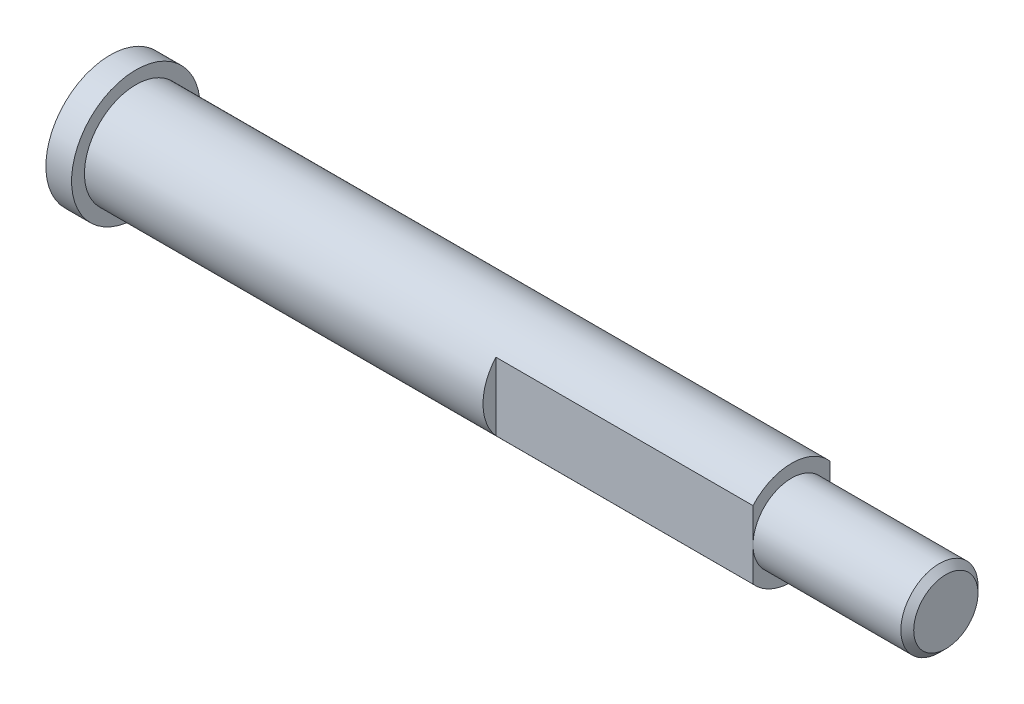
ISO-10303-21;
HEADER;
FILE_DESCRIPTION(('STEP AP214'),'2;1');
FILE_NAME('part.step','',(''),(''),'','','');
FILE_SCHEMA(('AUTOMOTIVE_DESIGN { 1 0 10303 214 1 1 1 1 }'));
ENDSEC;
DATA;
#1=APPLICATION_CONTEXT('core data for automotive mechanical design processes');
#2=APPLICATION_PROTOCOL_DEFINITION('international standard','automotive_design',2000,#1);
#3=PRODUCT_CONTEXT('',#1,'mechanical');
#4=PRODUCT('Part','Part','',(#3));
#5=PRODUCT_RELATED_PRODUCT_CATEGORY('part','',(#4));
#6=PRODUCT_DEFINITION_FORMATION('','',#4);
#7=PRODUCT_DEFINITION_CONTEXT('part definition',#1,'design');
#8=PRODUCT_DEFINITION('design','',#6,#7);
#9=PRODUCT_DEFINITION_SHAPE('','',#8);
#10=(LENGTH_UNIT() NAMED_UNIT(*) SI_UNIT(.MILLI.,.METRE.));
#11=(NAMED_UNIT(*) PLANE_ANGLE_UNIT() SI_UNIT($,.RADIAN.));
#12=(NAMED_UNIT(*) SI_UNIT($,.STERADIAN.) SOLID_ANGLE_UNIT());
#13=UNCERTAINTY_MEASURE_WITH_UNIT(LENGTH_MEASURE(1.E-05),#10,'distance_accuracy_value','');
#14=(GEOMETRIC_REPRESENTATION_CONTEXT(3) GLOBAL_UNCERTAINTY_ASSIGNED_CONTEXT((#13)) GLOBAL_UNIT_ASSIGNED_CONTEXT((#10,
#11,#12)) REPRESENTATION_CONTEXT('',''));
#15=CARTESIAN_POINT('',(0.,0.,0.));
#16=DIRECTION('',(0.,0.,1.));
#17=DIRECTION('',(1.,0.,0.));
#18=AXIS2_PLACEMENT_3D('',#15,#16,#17);
#19=CARTESIAN_POINT('',(63.,0.,0.));
#20=DIRECTION('',(1.,0.,0.));
#21=DIRECTION('',(0.,0.,-1.));
#22=AXIS2_PLACEMENT_3D('',#19,#20,#21);
#23=PLANE('',#22);
#24=CARTESIAN_POINT('',(62.9999999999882,0.,0.));
#25=DIRECTION('',(-1.,0.,0.));
#26=DIRECTION('',(0.,0.,1.));
#27=AXIS2_PLACEMENT_3D('',#24,#25,#26);
#28=CIRCLE('',#27,2.49995565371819);
#29=CARTESIAN_POINT('',(62.9999999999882,0.,2.49995565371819));
#30=VERTEX_POINT('',#29);
#31=EDGE_CURVE('E20',#30,#30,#28,.T.);
#32=ORIENTED_EDGE('',*,*,#31,.F.);
#33=EDGE_LOOP('',(#32));
#34=FACE_BOUND('',#33,.T.);
#35=ADVANCED_FACE('F16',(#34),#23,.T.);
#36=CARTESIAN_POINT('',(-2.,0.,0.));
#37=DIRECTION('',(1.,0.,0.));
#38=DIRECTION('',(0.,0.,-1.));
#39=AXIS2_PLACEMENT_3D('',#36,#37,#38);
#40=PLANE('',#39);
#41=CARTESIAN_POINT('',(-2.,0.,0.));
#42=DIRECTION('',(1.,0.,0.));
#43=DIRECTION('',(0.,0.,-1.));
#44=AXIS2_PLACEMENT_3D('',#41,#42,#43);
#45=CIRCLE('',#44,5.);
#46=CARTESIAN_POINT('',(-2.,0.,-5.));
#47=VERTEX_POINT('',#46);
#48=EDGE_CURVE('E114',#47,#47,#45,.T.);
#49=ORIENTED_EDGE('',*,*,#48,.F.);
#50=EDGE_LOOP('',(#49));
#51=FACE_BOUND('',#50,.T.);
#52=ADVANCED_FACE('F132',(#51),#40,.F.);
#53=CARTESIAN_POINT('',(62.4999467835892,0.,0.));
#54=DIRECTION('',(-1.,0.,0.));
#55=DIRECTION('',(0.,0.,1.));
#56=AXIS2_PLACEMENT_3D('',#53,#54,#55);
#57=CONICAL_SURFACE('',#56,2.9999999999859,0.785389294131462);
#58=CARTESIAN_POINT('',(62.49994678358,0.,0.));
#59=DIRECTION('',(1.,0.,0.));
#60=DIRECTION('',(0.,0.,-1.));
#61=AXIS2_PLACEMENT_3D('',#58,#59,#60);
#62=CIRCLE('',#61,3.);
#63=CARTESIAN_POINT('',(62.49994678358,0.,-3.));
#64=VERTEX_POINT('',#63);
#65=EDGE_CURVE('E72',#64,#64,#62,.F.);
#66=ORIENTED_EDGE('',*,*,#65,.F.);
#67=EDGE_LOOP('',(#66));
#68=FACE_BOUND('',#67,.T.);
#69=ORIENTED_EDGE('',*,*,#31,.T.);
#70=EDGE_LOOP('',(#69));
#71=FACE_BOUND('',#70,.T.);
#72=ADVANCED_FACE('F129',(#68,#71),#57,.T.);
#73=CARTESIAN_POINT('',(0.,0.,0.));
#74=DIRECTION('',(1.,0.,0.));
#75=DIRECTION('',(0.,0.,-1.));
#76=AXIS2_PLACEMENT_3D('',#73,#74,#75);
#77=CYLINDRICAL_SURFACE('',#76,5.);
#78=CARTESIAN_POINT('',(0.,0.,0.));
#79=DIRECTION('',(1.,0.,0.));
#80=DIRECTION('',(0.,0.,-1.));
#81=AXIS2_PLACEMENT_3D('',#78,#79,#80);
#82=CIRCLE('',#81,5.);
#83=CARTESIAN_POINT('',(0.,0.,-5.));
#84=VERTEX_POINT('',#83);
#85=EDGE_CURVE('E71',#84,#84,#82,.T.);
#86=ORIENTED_EDGE('',*,*,#85,.F.);
#87=EDGE_LOOP('',(#86));
#88=FACE_BOUND('',#87,.T.);
#89=ORIENTED_EDGE('',*,*,#48,.T.);
#90=EDGE_LOOP('',(#89));
#91=FACE_BOUND('',#90,.T.);
#92=ADVANCED_FACE('F158',(#88,#91),#77,.T.);
#93=CARTESIAN_POINT('',(51.,0.,0.));
#94=DIRECTION('',(1.,0.,0.));
#95=DIRECTION('',(0.,0.,-1.));
#96=AXIS2_PLACEMENT_3D('',#93,#94,#95);
#97=CYLINDRICAL_SURFACE('',#96,3.);
#98=ORIENTED_EDGE('',*,*,#65,.T.);
#99=EDGE_LOOP('',(#98));
#100=FACE_BOUND('',#99,.T.);
#101=CARTESIAN_POINT('',(51.,0.,0.));
#102=DIRECTION('',(1.,0.,0.));
#103=DIRECTION('',(0.,0.,-1.));
#104=AXIS2_PLACEMENT_3D('',#101,#102,#103);
#105=CIRCLE('',#104,3.);
#106=CARTESIAN_POINT('',(51.,0.,-3.));
#107=VERTEX_POINT('',#106);
#108=CARTESIAN_POINT('',(51.,0.,3.));
#109=VERTEX_POINT('',#108);
#110=EDGE_CURVE('E86',#107,#109,#105,.F.);
#111=ORIENTED_EDGE('',*,*,#110,.F.);
#112=CARTESIAN_POINT('',(51.,0.,0.));
#113=DIRECTION('',(1.,0.,0.));
#114=DIRECTION('',(0.,0.,-1.));
#115=AXIS2_PLACEMENT_3D('',#112,#113,#114);
#116=CIRCLE('',#115,3.);
#117=EDGE_CURVE('E61',#109,#107,#116,.F.);
#118=ORIENTED_EDGE('',*,*,#117,.F.);
#119=EDGE_LOOP('',(#111,#118));
#120=FACE_BOUND('',#119,.T.);
#121=ADVANCED_FACE('F87',(#100,#120),#97,.T.);
#122=CARTESIAN_POINT('',(51.,0.,0.));
#123=DIRECTION('',(1.,0.,0.));
#124=DIRECTION('',(0.,0.,-1.));
#125=AXIS2_PLACEMENT_3D('',#122,#123,#124);
#126=PLANE('',#125);
#127=DIRECTION('',(0.,1.,0.));
#128=VECTOR('',#127,1.);
#129=CARTESIAN_POINT('',(51.,-5.,3.));
#130=LINE('',#129,#128);
#131=CARTESIAN_POINT('',(51.,2.64575131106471,2.9999999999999));
#132=VERTEX_POINT('',#131);
#133=EDGE_CURVE('E69',#132,#109,#130,.F.);
#134=ORIENTED_EDGE('',*,*,#133,.T.);
#135=ORIENTED_EDGE('',*,*,#117,.T.);
#136=DIRECTION('',(0.,1.,0.));
#137=VECTOR('',#136,1.);
#138=CARTESIAN_POINT('',(51.,5.,-3.));
#139=LINE('',#138,#137);
#140=CARTESIAN_POINT('',(51.,2.64575131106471,-2.9999999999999));
#141=VERTEX_POINT('',#140);
#142=EDGE_CURVE('E67',#107,#141,#139,.T.);
#143=ORIENTED_EDGE('',*,*,#142,.T.);
#144=CARTESIAN_POINT('',(51.,0.,0.));
#145=DIRECTION('',(1.,0.,0.));
#146=DIRECTION('',(0.,0.,-1.));
#147=AXIS2_PLACEMENT_3D('',#144,#145,#146);
#148=CIRCLE('',#147,4.);
#149=EDGE_CURVE('E108',#132,#141,#148,.F.);
#150=ORIENTED_EDGE('',*,*,#149,.F.);
#151=EDGE_LOOP('',(#134,#135,#143,#150));
#152=FACE_BOUND('',#151,.T.);
#153=ADVANCED_FACE('F65',(#152),#126,.T.);
#154=CARTESIAN_POINT('',(0.,0.,0.));
#155=DIRECTION('',(1.,0.,0.));
#156=DIRECTION('',(0.,0.,-1.));
#157=AXIS2_PLACEMENT_3D('',#154,#155,#156);
#158=PLANE('',#157);
#159=CARTESIAN_POINT('',(0.,0.,0.));
#160=DIRECTION('',(1.,0.,0.));
#161=DIRECTION('',(0.,0.,-1.));
#162=AXIS2_PLACEMENT_3D('',#159,#160,#161);
#163=CIRCLE('',#162,4.);
#164=CARTESIAN_POINT('',(0.,0.,-4.));
#165=VERTEX_POINT('',#164);
#166=EDGE_CURVE('E107',#165,#165,#163,.T.);
#167=ORIENTED_EDGE('',*,*,#166,.F.);
#168=EDGE_LOOP('',(#167));
#169=FACE_BOUND('',#168,.T.);
#170=ORIENTED_EDGE('',*,*,#85,.T.);
#171=EDGE_LOOP('',(#170));
#172=FACE_BOUND('',#171,.T.);
#173=ADVANCED_FACE('F151',(#169,#172),#158,.T.);
#174=CARTESIAN_POINT('',(31.,0.,0.));
#175=DIRECTION('',(1.,0.,0.));
#176=DIRECTION('',(0.,0.,-1.));
#177=AXIS2_PLACEMENT_3D('',#174,#175,#176);
#178=PLANE('',#177);
#179=CARTESIAN_POINT('',(31.,0.,0.));
#180=DIRECTION('',(1.,0.,0.));
#181=DIRECTION('',(0.,0.,-1.));
#182=AXIS2_PLACEMENT_3D('',#179,#180,#181);
#183=CIRCLE('',#182,4.);
#184=CARTESIAN_POINT('',(31.,2.64575131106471,-2.9999999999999));
#185=VERTEX_POINT('',#184);
#186=CARTESIAN_POINT('',(31.,-2.64575131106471,-2.9999999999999));
#187=VERTEX_POINT('',#186);
#188=EDGE_CURVE('E105',#185,#187,#183,.F.);
#189=ORIENTED_EDGE('',*,*,#188,.F.);
#190=DIRECTION('',(0.,1.,0.));
#191=VECTOR('',#190,1.);
#192=CARTESIAN_POINT('',(31.,5.,-3.));
#193=LINE('',#192,#191);
#194=EDGE_CURVE('E84',#185,#187,#193,.F.);
#195=ORIENTED_EDGE('',*,*,#194,.T.);
#196=EDGE_LOOP('',(#189,#195));
#197=FACE_BOUND('',#196,.T.);
#198=ADVANCED_FACE('F154',(#197),#178,.T.);
#199=CARTESIAN_POINT('',(38.,5.,-3.));
#200=DIRECTION('',(0.,0.,1.));
#201=DIRECTION('',(1.,0.,0.));
#202=AXIS2_PLACEMENT_3D('',#199,#200,#201);
#203=PLANE('',#202);
#204=ORIENTED_EDGE('',*,*,#194,.F.);
#205=DIRECTION('',(1.,0.,0.));
#206=VECTOR('',#205,1.);
#207=CARTESIAN_POINT('',(0.,2.64575131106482,-2.9999999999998));
#208=LINE('',#207,#206);
#209=EDGE_CURVE('E82',#141,#185,#208,.F.);
#210=ORIENTED_EDGE('',*,*,#209,.F.);
#211=ORIENTED_EDGE('',*,*,#142,.F.);
#212=DIRECTION('',(0.,1.,0.));
#213=VECTOR('',#212,1.);
#214=CARTESIAN_POINT('',(51.,0.,-3.));
#215=LINE('',#214,#213);
#216=CARTESIAN_POINT('',(51.,-2.64575131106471,-2.9999999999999));
#217=VERTEX_POINT('',#216);
#218=EDGE_CURVE('E79',#217,#107,#215,.T.);
#219=ORIENTED_EDGE('',*,*,#218,.F.);
#220=DIRECTION('',(1.,0.,0.));
#221=VECTOR('',#220,1.);
#222=CARTESIAN_POINT('',(0.,-2.64575131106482,-2.9999999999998));
#223=LINE('',#222,#221);
#224=EDGE_CURVE('E104',#187,#217,#223,.T.);
#225=ORIENTED_EDGE('',*,*,#224,.F.);
#226=EDGE_LOOP('',(#204,#210,#211,#219,#225));
#227=FACE_BOUND('',#226,.T.);
#228=ADVANCED_FACE('F76',(#227),#203,.F.);
#229=CARTESIAN_POINT('',(51.,0.,0.));
#230=DIRECTION('',(1.,0.,0.));
#231=DIRECTION('',(0.,0.,-1.));
#232=AXIS2_PLACEMENT_3D('',#229,#230,#231);
#233=PLANE('',#232);
#234=DIRECTION('',(0.,1.,0.));
#235=VECTOR('',#234,1.);
#236=CARTESIAN_POINT('',(51.,-5.,3.));
#237=LINE('',#236,#235);
#238=CARTESIAN_POINT('',(51.,-2.64575131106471,2.9999999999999));
#239=VERTEX_POINT('',#238);
#240=EDGE_CURVE('E100',#109,#239,#237,.F.);
#241=ORIENTED_EDGE('',*,*,#240,.T.);
#242=CARTESIAN_POINT('',(51.,0.,0.));
#243=DIRECTION('',(1.,0.,0.));
#244=DIRECTION('',(0.,0.,-1.));
#245=AXIS2_PLACEMENT_3D('',#242,#243,#244);
#246=CIRCLE('',#245,4.);
#247=EDGE_CURVE('E93',#217,#239,#246,.F.);
#248=ORIENTED_EDGE('',*,*,#247,.F.);
#249=ORIENTED_EDGE('',*,*,#218,.T.);
#250=ORIENTED_EDGE('',*,*,#110,.T.);
#251=EDGE_LOOP('',(#241,#248,#249,#250));
#252=FACE_BOUND('',#251,.T.);
#253=ADVANCED_FACE('F91',(#252),#233,.T.);
#254=CARTESIAN_POINT('',(38.,-5.,3.));
#255=DIRECTION('',(0.,0.,-1.));
#256=DIRECTION('',(-1.,0.,0.));
#257=AXIS2_PLACEMENT_3D('',#254,#255,#256);
#258=PLANE('',#257);
#259=DIRECTION('',(0.,1.,0.));
#260=VECTOR('',#259,1.);
#261=CARTESIAN_POINT('',(31.,0.,3.));
#262=LINE('',#261,#260);
#263=CARTESIAN_POINT('',(31.,-2.64575131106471,2.9999999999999));
#264=VERTEX_POINT('',#263);
#265=CARTESIAN_POINT('',(31.,2.64575131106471,2.9999999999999));
#266=VERTEX_POINT('',#265);
#267=EDGE_CURVE('E35',#264,#266,#262,.T.);
#268=ORIENTED_EDGE('',*,*,#267,.F.);
#269=DIRECTION('',(1.,0.,0.));
#270=VECTOR('',#269,1.);
#271=CARTESIAN_POINT('',(0.,-2.64575131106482,2.9999999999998));
#272=LINE('',#271,#270);
#273=EDGE_CURVE('E26',#239,#264,#272,.F.);
#274=ORIENTED_EDGE('',*,*,#273,.F.);
#275=ORIENTED_EDGE('',*,*,#240,.F.);
#276=ORIENTED_EDGE('',*,*,#133,.F.);
#277=DIRECTION('',(1.,0.,0.));
#278=VECTOR('',#277,1.);
#279=CARTESIAN_POINT('',(0.,2.64575131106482,2.9999999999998));
#280=LINE('',#279,#278);
#281=EDGE_CURVE('E99',#266,#132,#280,.T.);
#282=ORIENTED_EDGE('',*,*,#281,.F.);
#283=EDGE_LOOP('',(#268,#274,#275,#276,#282));
#284=FACE_BOUND('',#283,.T.);
#285=ADVANCED_FACE('F146',(#284),#258,.F.);
#286=CARTESIAN_POINT('',(31.,0.,0.));
#287=DIRECTION('',(1.,0.,0.));
#288=DIRECTION('',(0.,0.,-1.));
#289=AXIS2_PLACEMENT_3D('',#286,#287,#288);
#290=PLANE('',#289);
#291=CARTESIAN_POINT('',(31.,0.,0.));
#292=DIRECTION('',(1.,0.,0.));
#293=DIRECTION('',(0.,0.,-1.));
#294=AXIS2_PLACEMENT_3D('',#291,#292,#293);
#295=CIRCLE('',#294,4.);
#296=EDGE_CURVE('E11',#264,#266,#295,.F.);
#297=ORIENTED_EDGE('',*,*,#296,.F.);
#298=ORIENTED_EDGE('',*,*,#267,.T.);
#299=EDGE_LOOP('',(#297,#298));
#300=FACE_BOUND('',#299,.T.);
#301=ADVANCED_FACE('F141',(#300),#290,.T.);
#302=CARTESIAN_POINT('',(0.,0.,0.));
#303=DIRECTION('',(1.,0.,0.));
#304=DIRECTION('',(0.,0.,-1.));
#305=AXIS2_PLACEMENT_3D('',#302,#303,#304);
#306=CYLINDRICAL_SURFACE('',#305,4.);
#307=ORIENTED_EDGE('',*,*,#209,.T.);
#308=ORIENTED_EDGE('',*,*,#188,.T.);
#309=ORIENTED_EDGE('',*,*,#224,.T.);
#310=ORIENTED_EDGE('',*,*,#247,.T.);
#311=ORIENTED_EDGE('',*,*,#273,.T.);
#312=ORIENTED_EDGE('',*,*,#296,.T.);
#313=ORIENTED_EDGE('',*,*,#281,.T.);
#314=ORIENTED_EDGE('',*,*,#149,.T.);
#315=EDGE_LOOP('',(#307,#308,#309,#310,#311,#312,#313,#314));
#316=FACE_BOUND('',#315,.T.);
#317=ORIENTED_EDGE('',*,*,#166,.T.);
#318=EDGE_LOOP('',(#317));
#319=FACE_BOUND('',#318,.T.);
#320=ADVANCED_FACE('F18',(#316,#319),#306,.T.);
#321=CLOSED_SHELL('',(#35,#52,#72,#92,#121,#153,#173,#198,#228,#253,#285,#301,#320));
#322=MANIFOLD_SOLID_BREP('B1',#321);
#323=ADVANCED_BREP_SHAPE_REPRESENTATION('',(#18,#322),#14);
#324=SHAPE_DEFINITION_REPRESENTATION(#9,#323);
ENDSEC;
END-ISO-10303-21;
